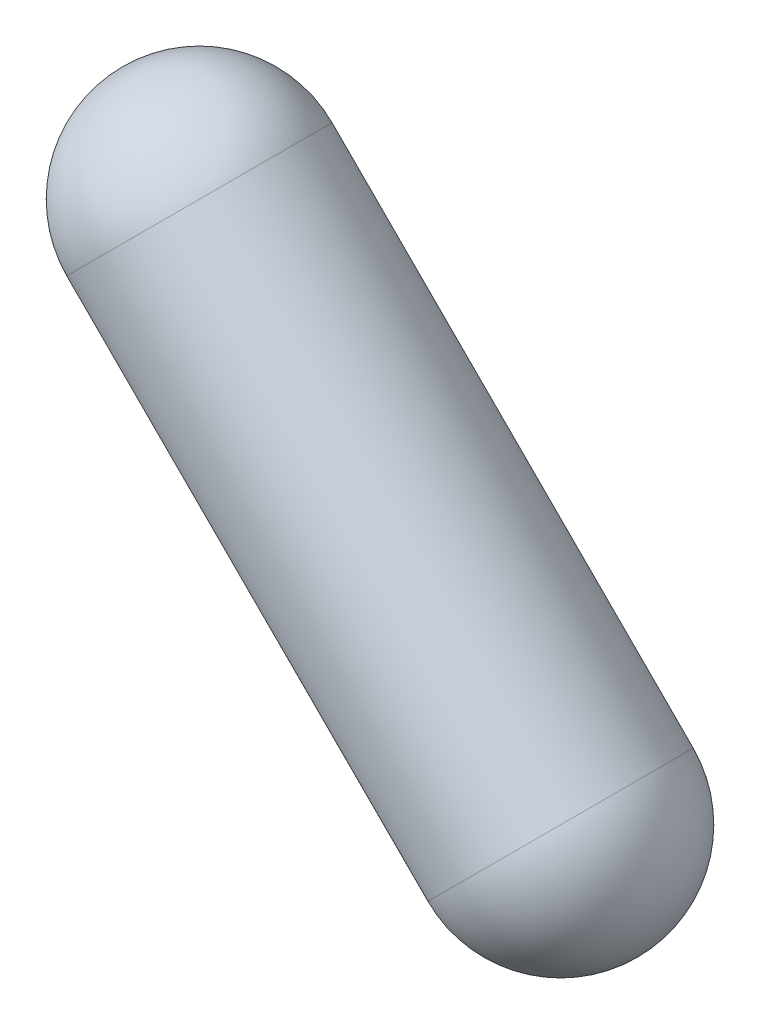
ISO-10303-21;
HEADER;
FILE_DESCRIPTION(('STEP AP214'),'2;1');
FILE_NAME('part.step','',(''),(''),'','','');
FILE_SCHEMA(('AUTOMOTIVE_DESIGN { 1 0 10303 214 1 1 1 1 }'));
ENDSEC;
DATA;
#1=APPLICATION_CONTEXT('core data for automotive mechanical design processes');
#2=APPLICATION_PROTOCOL_DEFINITION('international standard','automotive_design',2000,#1);
#3=PRODUCT_CONTEXT('',#1,'mechanical');
#4=PRODUCT('Part','Part','',(#3));
#5=PRODUCT_RELATED_PRODUCT_CATEGORY('part','',(#4));
#6=PRODUCT_DEFINITION_FORMATION('','',#4);
#7=PRODUCT_DEFINITION_CONTEXT('part definition',#1,'design');
#8=PRODUCT_DEFINITION('design','',#6,#7);
#9=PRODUCT_DEFINITION_SHAPE('','',#8);
#10=(LENGTH_UNIT() NAMED_UNIT(*) SI_UNIT(.MILLI.,.METRE.));
#11=(NAMED_UNIT(*) PLANE_ANGLE_UNIT() SI_UNIT($,.RADIAN.));
#12=(NAMED_UNIT(*) SI_UNIT($,.STERADIAN.) SOLID_ANGLE_UNIT());
#13=UNCERTAINTY_MEASURE_WITH_UNIT(LENGTH_MEASURE(1.E-05),#10,'distance_accuracy_value','');
#14=(GEOMETRIC_REPRESENTATION_CONTEXT(3) GLOBAL_UNCERTAINTY_ASSIGNED_CONTEXT((#13)) GLOBAL_UNIT_ASSIGNED_CONTEXT((#10,
#11,#12)) REPRESENTATION_CONTEXT('',''));
#15=CARTESIAN_POINT('',(0.,0.,0.));
#16=DIRECTION('',(0.,0.,1.));
#17=DIRECTION('',(1.,0.,0.));
#18=AXIS2_PLACEMENT_3D('',#15,#16,#17);
#19=CARTESIAN_POINT('',(-92.5,-45.,0.));
#20=DIRECTION('',(-0.707106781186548,0.707106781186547,0.));
#21=DIRECTION('',(0.,0.,-1.));
#22=AXIS2_PLACEMENT_3D('',#19,#20,#21);
#23=CYLINDRICAL_SURFACE('',#22,1.49999999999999);
#24=CARTESIAN_POINT('',(-97.5,-40.,0.));
#25=DIRECTION('',(-0.70710678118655,0.707106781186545,0.));
#26=DIRECTION('',(-0.707106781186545,-0.70710678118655,0.));
#27=AXIS2_PLACEMENT_3D('',#24,#25,#26);
#28=CIRCLE('',#27,1.5);
#29=CARTESIAN_POINT('',(-97.5,-40.,-1.49999999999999));
#30=VERTEX_POINT('',#29);
#31=CARTESIAN_POINT('',(-97.5,-40.,1.5));
#32=VERTEX_POINT('',#31);
#33=EDGE_CURVE('E11',#30,#32,#28,.T.);
#34=ORIENTED_EDGE('',*,*,#33,.F.);
#35=CARTESIAN_POINT('',(-97.5,-40.,0.));
#36=DIRECTION('',(0.70710678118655,-0.707106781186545,0.));
#37=DIRECTION('',(0.707106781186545,0.70710678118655,0.));
#38=AXIS2_PLACEMENT_3D('',#35,#36,#37);
#39=CIRCLE('',#38,1.5);
#40=EDGE_CURVE('E24',#30,#32,#39,.T.);
#41=ORIENTED_EDGE('',*,*,#40,.T.);
#42=EDGE_LOOP('',(#34,#41));
#43=FACE_BOUND('',#42,.T.);
#44=CARTESIAN_POINT('',(-92.5,-45.,0.));
#45=DIRECTION('',(-0.70710678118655,0.707106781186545,0.));
#46=DIRECTION('',(-0.707106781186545,-0.70710678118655,0.));
#47=AXIS2_PLACEMENT_3D('',#44,#45,#46);
#48=CIRCLE('',#47,1.5);
#49=CARTESIAN_POINT('',(-92.5,-45.,-1.5));
#50=VERTEX_POINT('',#49);
#51=CARTESIAN_POINT('',(-92.5,-45.,1.49999999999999));
#52=VERTEX_POINT('',#51);
#53=EDGE_CURVE('E41',#50,#52,#48,.T.);
#54=ORIENTED_EDGE('',*,*,#53,.T.);
#55=CARTESIAN_POINT('',(-92.5,-45.,0.));
#56=DIRECTION('',(0.70710678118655,-0.707106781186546,0.));
#57=DIRECTION('',(0.707106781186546,0.70710678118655,0.));
#58=AXIS2_PLACEMENT_3D('',#55,#56,#57);
#59=CIRCLE('',#58,1.5);
#60=EDGE_CURVE('E30',#50,#52,#59,.T.);
#61=ORIENTED_EDGE('',*,*,#60,.F.);
#62=EDGE_LOOP('',(#54,#61));
#63=FACE_BOUND('',#62,.T.);
#64=ADVANCED_FACE('F16',(#43,#63),#23,.T.);
#65=CARTESIAN_POINT('',(-97.5,-40.,0.));
#66=DIRECTION('',(0.,0.,1.));
#67=DIRECTION('',(-0.707106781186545,-0.70710678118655,0.));
#68=AXIS2_PLACEMENT_3D('',#65,#66,#67);
#69=SPHERICAL_SURFACE('',#68,1.5);
#70=CARTESIAN_POINT('',(-97.5,-40.,0.));
#71=DIRECTION('',(-0.70710678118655,0.707106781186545,0.));
#72=DIRECTION('',(-0.707106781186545,-0.70710678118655,0.));
#73=AXIS2_PLACEMENT_3D('',#70,#71,#72);
#74=SPHERICAL_SURFACE('',#73,1.5);
#75=ORIENTED_EDGE('',*,*,#33,.T.);
#76=ORIENTED_EDGE('',*,*,#40,.F.);
#77=EDGE_LOOP('',(#75,#76));
#78=FACE_BOUND('',#77,.T.);
#79=ADVANCED_FACE('F62',(#78),#74,.T.);
#80=CARTESIAN_POINT('',(-92.5,-45.,0.));
#81=DIRECTION('',(0.,0.,1.));
#82=DIRECTION('',(0.707106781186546,0.70710678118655,0.));
#83=AXIS2_PLACEMENT_3D('',#80,#81,#82);
#84=SPHERICAL_SURFACE('',#83,1.5);
#85=CARTESIAN_POINT('',(-92.5,-45.,0.));
#86=DIRECTION('',(0.70710678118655,-0.707106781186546,0.));
#87=DIRECTION('',(0.707106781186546,0.70710678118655,0.));
#88=AXIS2_PLACEMENT_3D('',#85,#86,#87);
#89=SPHERICAL_SURFACE('',#88,1.5);
#90=ORIENTED_EDGE('',*,*,#60,.T.);
#91=ORIENTED_EDGE('',*,*,#53,.F.);
#92=EDGE_LOOP('',(#90,#91));
#93=FACE_BOUND('',#92,.T.);
#94=ADVANCED_FACE('F44',(#93),#89,.T.);
#95=CLOSED_SHELL('',(#64,#79,#94));
#96=MANIFOLD_SOLID_BREP('B1',#95);
#97=ADVANCED_BREP_SHAPE_REPRESENTATION('',(#18,#96),#14);
#98=SHAPE_DEFINITION_REPRESENTATION(#9,#97);
ENDSEC;
END-ISO-10303-21;
